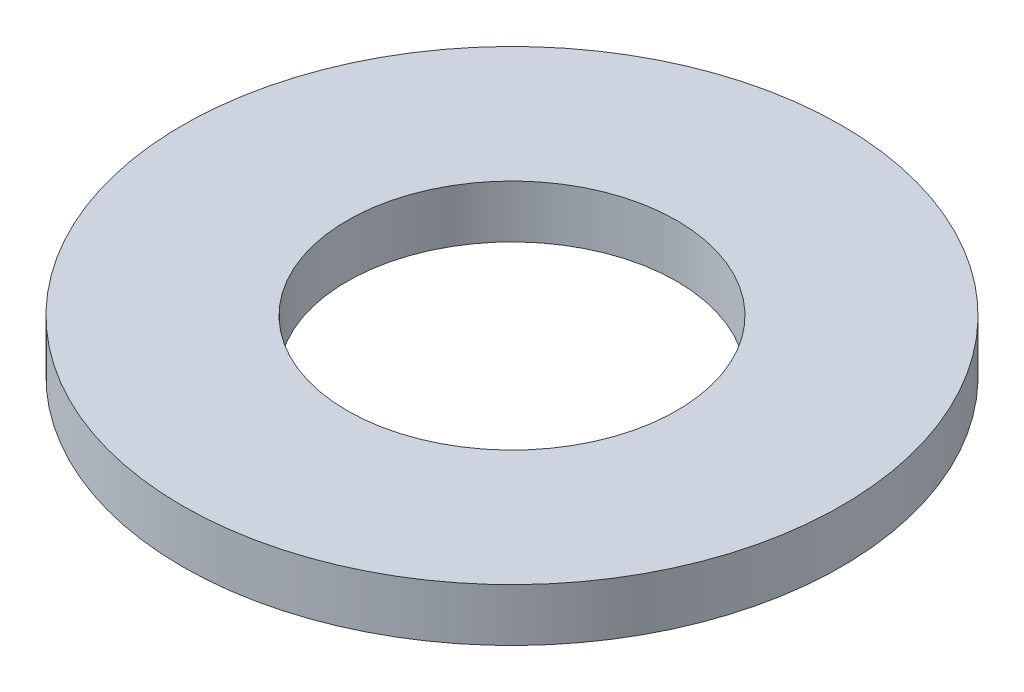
from build123d import *

# Parameters (mm, degrees)
ESQUISSE1_W = 12.5
ESQUISSE1_H = 4


with BuildPart() as part:
    # Esquisse1 → Base (revolve)
    with BuildSketch(Plane.XY, mode=Mode.PRIVATE) as base_sk:
        with Locations((18.75, 2)):
            Rectangle(ESQUISSE1_W, ESQUISSE1_H)
    revolve(base_sk.sketch.rotate(Axis((0, 0, 0), (0, 1, 0)), 90), axis=Axis((0, 0, 0), (0, 1, 0)))


solid = part.part
